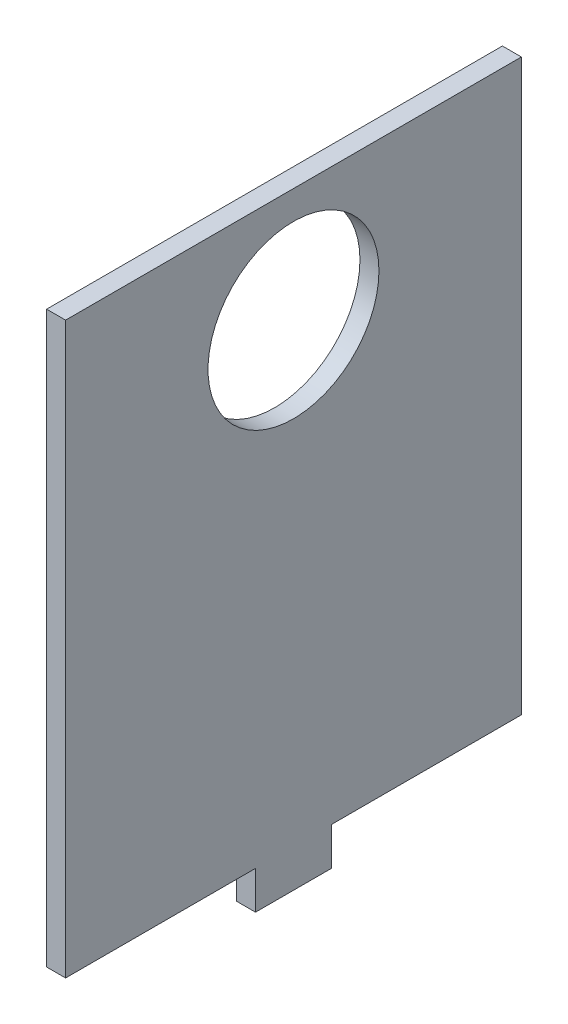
ISO-10303-21;
HEADER;
FILE_DESCRIPTION(('STEP AP214'),'2;1');
FILE_NAME('part.step','',(''),(''),'','','');
FILE_SCHEMA(('AUTOMOTIVE_DESIGN { 1 0 10303 214 1 1 1 1 }'));
ENDSEC;
DATA;
#1=APPLICATION_CONTEXT('core data for automotive mechanical design processes');
#2=APPLICATION_PROTOCOL_DEFINITION('international standard','automotive_design',2000,#1);
#3=PRODUCT_CONTEXT('',#1,'mechanical');
#4=PRODUCT('Part','Part','',(#3));
#5=PRODUCT_RELATED_PRODUCT_CATEGORY('part','',(#4));
#6=PRODUCT_DEFINITION_FORMATION('','',#4);
#7=PRODUCT_DEFINITION_CONTEXT('part definition',#1,'design');
#8=PRODUCT_DEFINITION('design','',#6,#7);
#9=PRODUCT_DEFINITION_SHAPE('','',#8);
#10=(LENGTH_UNIT() NAMED_UNIT(*) SI_UNIT(.MILLI.,.METRE.));
#11=(NAMED_UNIT(*) PLANE_ANGLE_UNIT() SI_UNIT($,.RADIAN.));
#12=(NAMED_UNIT(*) SI_UNIT($,.STERADIAN.) SOLID_ANGLE_UNIT());
#13=UNCERTAINTY_MEASURE_WITH_UNIT(LENGTH_MEASURE(1.E-05),#10,'distance_accuracy_value','');
#14=(GEOMETRIC_REPRESENTATION_CONTEXT(3) GLOBAL_UNCERTAINTY_ASSIGNED_CONTEXT((#13)) GLOBAL_UNIT_ASSIGNED_CONTEXT((#10,
#11,#12)) REPRESENTATION_CONTEXT('',''));
#15=CARTESIAN_POINT('',(0.,0.,0.));
#16=DIRECTION('',(0.,0.,1.));
#17=DIRECTION('',(1.,0.,0.));
#18=AXIS2_PLACEMENT_3D('',#15,#16,#17);
#19=CARTESIAN_POINT('',(6.35,0.,0.));
#20=DIRECTION('',(0.,1.,0.));
#21=DIRECTION('',(0.,0.,1.));
#22=AXIS2_PLACEMENT_3D('',#19,#20,#21);
#23=PLANE('',#22);
#24=DIRECTION('',(0.,0.,-1.));
#25=VECTOR('',#24,1.);
#26=CARTESIAN_POINT('',(6.35,0.,0.));
#27=LINE('',#26,#25);
#28=CARTESIAN_POINT('',(6.35,0.,-63.5));
#29=VERTEX_POINT('',#28);
#30=CARTESIAN_POINT('',(6.35,0.,-88.9));
#31=VERTEX_POINT('',#30);
#32=EDGE_CURVE('E180',#29,#31,#27,.T.);
#33=ORIENTED_EDGE('',*,*,#32,.F.);
#34=DIRECTION('',(1.,0.,0.));
#35=VECTOR('',#34,1.);
#36=CARTESIAN_POINT('',(0.,0.,-63.5));
#37=LINE('',#36,#35);
#38=CARTESIAN_POINT('',(0.,0.,-63.5));
#39=VERTEX_POINT('',#38);
#40=EDGE_CURVE('E148',#39,#29,#37,.T.);
#41=ORIENTED_EDGE('',*,*,#40,.F.);
#42=DIRECTION('',(0.,0.,-1.));
#43=VECTOR('',#42,1.);
#44=CARTESIAN_POINT('',(0.,0.,0.));
#45=LINE('',#44,#43);
#46=CARTESIAN_POINT('',(0.,0.,-88.9));
#47=VERTEX_POINT('',#46);
#48=EDGE_CURVE('E135',#39,#47,#45,.T.);
#49=ORIENTED_EDGE('',*,*,#48,.T.);
#50=DIRECTION('',(1.,0.,0.));
#51=VECTOR('',#50,1.);
#52=CARTESIAN_POINT('',(0.,0.,-88.9));
#53=LINE('',#52,#51);
#54=EDGE_CURVE('E65',#47,#31,#53,.T.);
#55=ORIENTED_EDGE('',*,*,#54,.T.);
#56=EDGE_LOOP('',(#33,#41,#49,#55));
#57=FACE_BOUND('',#56,.T.);
#58=ADVANCED_FACE('F49',(#57),#23,.F.);
#59=CARTESIAN_POINT('',(6.35,0.,-152.4));
#60=DIRECTION('',(0.,0.,1.));
#61=DIRECTION('',(1.,0.,0.));
#62=AXIS2_PLACEMENT_3D('',#59,#60,#61);
#63=PLANE('',#62);
#64=DIRECTION('',(1.,0.,0.));
#65=VECTOR('',#64,1.);
#66=CARTESIAN_POINT('',(0.,12.7,-152.4));
#67=LINE('',#66,#65);
#68=CARTESIAN_POINT('',(0.,12.7,-152.4));
#69=VERTEX_POINT('',#68);
#70=CARTESIAN_POINT('',(6.35,12.7,-152.4));
#71=VERTEX_POINT('',#70);
#72=EDGE_CURVE('E146',#69,#71,#67,.T.);
#73=ORIENTED_EDGE('',*,*,#72,.F.);
#74=DIRECTION('',(0.,1.,0.));
#75=VECTOR('',#74,1.);
#76=CARTESIAN_POINT('',(0.,0.,-152.4));
#77=LINE('',#76,#75);
#78=CARTESIAN_POINT('',(0.,203.2,-152.4));
#79=VERTEX_POINT('',#78);
#80=EDGE_CURVE('E195',#69,#79,#77,.T.);
#81=ORIENTED_EDGE('',*,*,#80,.T.);
#82=DIRECTION('',(-1.,0.,0.));
#83=VECTOR('',#82,1.);
#84=CARTESIAN_POINT('',(6.35,203.2,-152.4));
#85=LINE('',#84,#83);
#86=CARTESIAN_POINT('',(6.35,203.2,-152.4));
#87=VERTEX_POINT('',#86);
#88=EDGE_CURVE('E11',#87,#79,#85,.T.);
#89=ORIENTED_EDGE('',*,*,#88,.F.);
#90=DIRECTION('',(0.,1.,0.));
#91=VECTOR('',#90,1.);
#92=CARTESIAN_POINT('',(6.35,0.,-152.4));
#93=LINE('',#92,#91);
#94=EDGE_CURVE('E185',#71,#87,#93,.T.);
#95=ORIENTED_EDGE('',*,*,#94,.F.);
#96=EDGE_LOOP('',(#73,#81,#89,#95));
#97=FACE_BOUND('',#96,.T.);
#98=ADVANCED_FACE('F214',(#97),#63,.F.);
#99=CARTESIAN_POINT('',(6.35,0.,0.));
#100=DIRECTION('',(-1.,0.,0.));
#101=DIRECTION('',(0.,0.,1.));
#102=AXIS2_PLACEMENT_3D('',#99,#100,#101);
#103=PLANE('',#102);
#104=CARTESIAN_POINT('',(6.35,165.1,-76.2));
#105=DIRECTION('',(1.,0.,0.));
#106=DIRECTION('',(0.,0.,-1.));
#107=AXIS2_PLACEMENT_3D('',#104,#105,#106);
#108=CIRCLE('',#107,28.575);
#109=CARTESIAN_POINT('',(6.35,165.1,-104.775));
#110=VERTEX_POINT('',#109);
#111=EDGE_CURVE('E142',#110,#110,#108,.T.);
#112=ORIENTED_EDGE('',*,*,#111,.F.);
#113=EDGE_LOOP('',(#112));
#114=FACE_BOUND('',#113,.T.);
#115=DIRECTION('',(0.,0.,1.));
#116=VECTOR('',#115,1.);
#117=CARTESIAN_POINT('',(6.35,12.7,0.));
#118=LINE('',#117,#116);
#119=CARTESIAN_POINT('',(6.35,12.7,-63.5));
#120=VERTEX_POINT('',#119);
#121=CARTESIAN_POINT('',(6.35,12.7,0.));
#122=VERTEX_POINT('',#121);
#123=EDGE_CURVE('E137',#120,#122,#118,.T.);
#124=ORIENTED_EDGE('',*,*,#123,.F.);
#125=DIRECTION('',(0.,1.,0.));
#126=VECTOR('',#125,1.);
#127=CARTESIAN_POINT('',(6.35,0.,-63.5));
#128=LINE('',#127,#126);
#129=EDGE_CURVE('E121',#29,#120,#128,.T.);
#130=ORIENTED_EDGE('',*,*,#129,.F.);
#131=ORIENTED_EDGE('',*,*,#32,.T.);
#132=DIRECTION('',(0.,1.,0.));
#133=VECTOR('',#132,1.);
#134=CARTESIAN_POINT('',(6.35,0.,-88.9));
#135=LINE('',#134,#133);
#136=CARTESIAN_POINT('',(6.35,12.7,-88.9));
#137=VERTEX_POINT('',#136);
#138=EDGE_CURVE('E158',#31,#137,#135,.T.);
#139=ORIENTED_EDGE('',*,*,#138,.T.);
#140=DIRECTION('',(0.,0.,-1.));
#141=VECTOR('',#140,1.);
#142=CARTESIAN_POINT('',(6.35,12.7,0.));
#143=LINE('',#142,#141);
#144=EDGE_CURVE('E162',#137,#71,#143,.T.);
#145=ORIENTED_EDGE('',*,*,#144,.T.);
#146=ORIENTED_EDGE('',*,*,#94,.T.);
#147=DIRECTION('',(0.,0.,1.));
#148=VECTOR('',#147,1.);
#149=CARTESIAN_POINT('',(6.35,203.2,0.));
#150=LINE('',#149,#148);
#151=CARTESIAN_POINT('',(6.35,203.2,0.));
#152=VERTEX_POINT('',#151);
#153=EDGE_CURVE('E188',#87,#152,#150,.T.);
#154=ORIENTED_EDGE('',*,*,#153,.T.);
#155=DIRECTION('',(0.,-1.,0.));
#156=VECTOR('',#155,1.);
#157=CARTESIAN_POINT('',(6.35,0.,0.));
#158=LINE('',#157,#156);
#159=EDGE_CURVE('E176',#152,#122,#158,.T.);
#160=ORIENTED_EDGE('',*,*,#159,.T.);
#161=EDGE_LOOP('',(#124,#130,#131,#139,#145,#146,#154,#160));
#162=FACE_BOUND('',#161,.T.);
#163=ADVANCED_FACE('F220',(#114,#162),#103,.F.);
#164=CARTESIAN_POINT('',(0.,0.,0.));
#165=DIRECTION('',(-1.,0.,0.));
#166=DIRECTION('',(0.,0.,1.));
#167=AXIS2_PLACEMENT_3D('',#164,#165,#166);
#168=PLANE('',#167);
#169=CARTESIAN_POINT('',(0.,165.1,-76.2));
#170=DIRECTION('',(1.,0.,0.));
#171=DIRECTION('',(0.,0.,-1.));
#172=AXIS2_PLACEMENT_3D('',#169,#170,#171);
#173=CIRCLE('',#172,28.575);
#174=CARTESIAN_POINT('',(0.,165.1,-104.775));
#175=VERTEX_POINT('',#174);
#176=EDGE_CURVE('E166',#175,#175,#173,.T.);
#177=ORIENTED_EDGE('',*,*,#176,.T.);
#178=EDGE_LOOP('',(#177));
#179=FACE_BOUND('',#178,.T.);
#180=DIRECTION('',(0.,1.,0.));
#181=VECTOR('',#180,1.);
#182=CARTESIAN_POINT('',(0.,0.,-63.5));
#183=LINE('',#182,#181);
#184=CARTESIAN_POINT('',(0.,12.7,-63.5));
#185=VERTEX_POINT('',#184);
#186=EDGE_CURVE('E118',#39,#185,#183,.T.);
#187=ORIENTED_EDGE('',*,*,#186,.T.);
#188=DIRECTION('',(0.,0.,1.));
#189=VECTOR('',#188,1.);
#190=CARTESIAN_POINT('',(0.,12.7,0.));
#191=LINE('',#190,#189);
#192=CARTESIAN_POINT('',(0.,12.7,0.));
#193=VERTEX_POINT('',#192);
#194=EDGE_CURVE('E124',#185,#193,#191,.T.);
#195=ORIENTED_EDGE('',*,*,#194,.T.);
#196=DIRECTION('',(0.,-1.,0.));
#197=VECTOR('',#196,1.);
#198=CARTESIAN_POINT('',(0.,0.,0.));
#199=LINE('',#198,#197);
#200=CARTESIAN_POINT('',(0.,203.2,0.));
#201=VERTEX_POINT('',#200);
#202=EDGE_CURVE('E151',#201,#193,#199,.T.);
#203=ORIENTED_EDGE('',*,*,#202,.F.);
#204=DIRECTION('',(0.,0.,1.));
#205=VECTOR('',#204,1.);
#206=CARTESIAN_POINT('',(0.,203.2,0.));
#207=LINE('',#206,#205);
#208=EDGE_CURVE('E181',#79,#201,#207,.T.);
#209=ORIENTED_EDGE('',*,*,#208,.F.);
#210=ORIENTED_EDGE('',*,*,#80,.F.);
#211=DIRECTION('',(0.,0.,-1.));
#212=VECTOR('',#211,1.);
#213=CARTESIAN_POINT('',(0.,12.7,0.));
#214=LINE('',#213,#212);
#215=CARTESIAN_POINT('',(0.,12.7,-88.9));
#216=VERTEX_POINT('',#215);
#217=EDGE_CURVE('E154',#216,#69,#214,.T.);
#218=ORIENTED_EDGE('',*,*,#217,.F.);
#219=DIRECTION('',(0.,1.,0.));
#220=VECTOR('',#219,1.);
#221=CARTESIAN_POINT('',(0.,0.,-88.9));
#222=LINE('',#221,#220);
#223=EDGE_CURVE('E157',#47,#216,#222,.T.);
#224=ORIENTED_EDGE('',*,*,#223,.F.);
#225=ORIENTED_EDGE('',*,*,#48,.F.);
#226=EDGE_LOOP('',(#187,#195,#203,#209,#210,#218,#224,#225));
#227=FACE_BOUND('',#226,.T.);
#228=ADVANCED_FACE('F133',(#179,#227),#168,.T.);
#229=CARTESIAN_POINT('',(6.35,0.,0.));
#230=DIRECTION('',(0.,0.,-1.));
#231=DIRECTION('',(-1.,0.,0.));
#232=AXIS2_PLACEMENT_3D('',#229,#230,#231);
#233=PLANE('',#232);
#234=ORIENTED_EDGE('',*,*,#202,.T.);
#235=DIRECTION('',(1.,0.,0.));
#236=VECTOR('',#235,1.);
#237=CARTESIAN_POINT('',(0.,12.7,0.));
#238=LINE('',#237,#236);
#239=EDGE_CURVE('E73',#193,#122,#238,.T.);
#240=ORIENTED_EDGE('',*,*,#239,.T.);
#241=ORIENTED_EDGE('',*,*,#159,.F.);
#242=DIRECTION('',(-1.,0.,0.));
#243=VECTOR('',#242,1.);
#244=CARTESIAN_POINT('',(6.35,203.2,0.));
#245=LINE('',#244,#243);
#246=EDGE_CURVE('E58',#152,#201,#245,.T.);
#247=ORIENTED_EDGE('',*,*,#246,.T.);
#248=EDGE_LOOP('',(#234,#240,#241,#247));
#249=FACE_BOUND('',#248,.T.);
#250=ADVANCED_FACE('F51',(#249),#233,.F.);
#251=CARTESIAN_POINT('',(6.35,203.2,0.));
#252=DIRECTION('',(0.,-1.,0.));
#253=DIRECTION('',(0.,0.,-1.));
#254=AXIS2_PLACEMENT_3D('',#251,#252,#253);
#255=PLANE('',#254);
#256=ORIENTED_EDGE('',*,*,#208,.T.);
#257=ORIENTED_EDGE('',*,*,#246,.F.);
#258=ORIENTED_EDGE('',*,*,#153,.F.);
#259=ORIENTED_EDGE('',*,*,#88,.T.);
#260=EDGE_LOOP('',(#256,#257,#258,#259));
#261=FACE_BOUND('',#260,.T.);
#262=ADVANCED_FACE('F209',(#261),#255,.F.);
#263=CARTESIAN_POINT('',(0.,12.7,0.));
#264=DIRECTION('',(0.,-1.,0.));
#265=DIRECTION('',(0.,0.,-1.));
#266=AXIS2_PLACEMENT_3D('',#263,#264,#265);
#267=PLANE('',#266);
#268=ORIENTED_EDGE('',*,*,#144,.F.);
#269=DIRECTION('',(1.,0.,0.));
#270=VECTOR('',#269,1.);
#271=CARTESIAN_POINT('',(0.,12.7,-88.9));
#272=LINE('',#271,#270);
#273=EDGE_CURVE('E161',#216,#137,#272,.T.);
#274=ORIENTED_EDGE('',*,*,#273,.F.);
#275=ORIENTED_EDGE('',*,*,#217,.T.);
#276=ORIENTED_EDGE('',*,*,#72,.T.);
#277=EDGE_LOOP('',(#268,#274,#275,#276));
#278=FACE_BOUND('',#277,.T.);
#279=ADVANCED_FACE('F217',(#278),#267,.T.);
#280=CARTESIAN_POINT('',(0.,0.,-88.9));
#281=DIRECTION('',(0.,0.,-1.));
#282=DIRECTION('',(-1.,0.,0.));
#283=AXIS2_PLACEMENT_3D('',#280,#281,#282);
#284=PLANE('',#283);
#285=ORIENTED_EDGE('',*,*,#138,.F.);
#286=ORIENTED_EDGE('',*,*,#54,.F.);
#287=ORIENTED_EDGE('',*,*,#223,.T.);
#288=ORIENTED_EDGE('',*,*,#273,.T.);
#289=EDGE_LOOP('',(#285,#286,#287,#288));
#290=FACE_BOUND('',#289,.T.);
#291=ADVANCED_FACE('F222',(#290),#284,.T.);
#292=CARTESIAN_POINT('',(0.,0.,-63.5));
#293=DIRECTION('',(0.,0.,-1.));
#294=DIRECTION('',(-1.,0.,0.));
#295=AXIS2_PLACEMENT_3D('',#292,#293,#294);
#296=PLANE('',#295);
#297=ORIENTED_EDGE('',*,*,#129,.T.);
#298=DIRECTION('',(1.,0.,0.));
#299=VECTOR('',#298,1.);
#300=CARTESIAN_POINT('',(0.,12.7,-63.5));
#301=LINE('',#300,#299);
#302=EDGE_CURVE('E115',#185,#120,#301,.T.);
#303=ORIENTED_EDGE('',*,*,#302,.F.);
#304=ORIENTED_EDGE('',*,*,#186,.F.);
#305=ORIENTED_EDGE('',*,*,#40,.T.);
#306=EDGE_LOOP('',(#297,#303,#304,#305));
#307=FACE_BOUND('',#306,.T.);
#308=ADVANCED_FACE('F116',(#307),#296,.F.);
#309=CARTESIAN_POINT('',(0.,12.7,0.));
#310=DIRECTION('',(0.,1.,0.));
#311=DIRECTION('',(0.,0.,1.));
#312=AXIS2_PLACEMENT_3D('',#309,#310,#311);
#313=PLANE('',#312);
#314=ORIENTED_EDGE('',*,*,#123,.T.);
#315=ORIENTED_EDGE('',*,*,#239,.F.);
#316=ORIENTED_EDGE('',*,*,#194,.F.);
#317=ORIENTED_EDGE('',*,*,#302,.T.);
#318=EDGE_LOOP('',(#314,#315,#316,#317));
#319=FACE_BOUND('',#318,.T.);
#320=ADVANCED_FACE('F126',(#319),#313,.F.);
#321=CARTESIAN_POINT('',(0.,165.1,-76.2));
#322=DIRECTION('',(1.,0.,0.));
#323=DIRECTION('',(0.,0.,-1.));
#324=AXIS2_PLACEMENT_3D('',#321,#322,#323);
#325=CYLINDRICAL_SURFACE('',#324,28.575);
#326=ORIENTED_EDGE('',*,*,#176,.F.);
#327=EDGE_LOOP('',(#326));
#328=FACE_BOUND('',#327,.T.);
#329=ORIENTED_EDGE('',*,*,#111,.T.);
#330=EDGE_LOOP('',(#329));
#331=FACE_BOUND('',#330,.T.);
#332=ADVANCED_FACE('F246',(#328,#331),#325,.F.);
#333=CLOSED_SHELL('',(#58,#98,#163,#228,#250,#262,#279,#291,#308,#320,#332));
#334=MANIFOLD_SOLID_BREP('B2',#333);
#335=ADVANCED_BREP_SHAPE_REPRESENTATION('',(#18,#334),#14);
#336=SHAPE_DEFINITION_REPRESENTATION(#9,#335);
ENDSEC;
END-ISO-10303-21;
